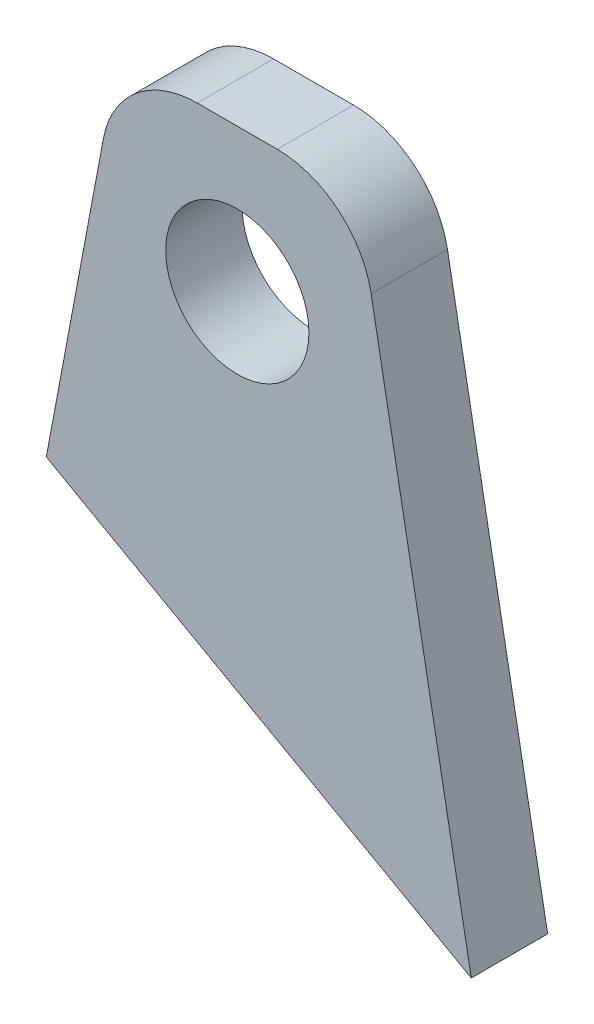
ISO-10303-21;
HEADER;
FILE_DESCRIPTION(('STEP AP214'),'2;1');
FILE_NAME('part.step','',(''),(''),'','','');
FILE_SCHEMA(('AUTOMOTIVE_DESIGN { 1 0 10303 214 1 1 1 1 }'));
ENDSEC;
DATA;
#1=APPLICATION_CONTEXT('core data for automotive mechanical design processes');
#2=APPLICATION_PROTOCOL_DEFINITION('international standard','automotive_design',2000,#1);
#3=PRODUCT_CONTEXT('',#1,'mechanical');
#4=PRODUCT('Part','Part','',(#3));
#5=PRODUCT_RELATED_PRODUCT_CATEGORY('part','',(#4));
#6=PRODUCT_DEFINITION_FORMATION('','',#4);
#7=PRODUCT_DEFINITION_CONTEXT('part definition',#1,'design');
#8=PRODUCT_DEFINITION('design','',#6,#7);
#9=PRODUCT_DEFINITION_SHAPE('','',#8);
#10=(LENGTH_UNIT() NAMED_UNIT(*) SI_UNIT(.MILLI.,.METRE.));
#11=(NAMED_UNIT(*) PLANE_ANGLE_UNIT() SI_UNIT($,.RADIAN.));
#12=(NAMED_UNIT(*) SI_UNIT($,.STERADIAN.) SOLID_ANGLE_UNIT());
#13=UNCERTAINTY_MEASURE_WITH_UNIT(LENGTH_MEASURE(1.E-05),#10,'distance_accuracy_value','');
#14=(GEOMETRIC_REPRESENTATION_CONTEXT(3) GLOBAL_UNCERTAINTY_ASSIGNED_CONTEXT((#13)) GLOBAL_UNIT_ASSIGNED_CONTEXT((#10,
#11,#12)) REPRESENTATION_CONTEXT('',''));
#15=CARTESIAN_POINT('',(0.,0.,0.));
#16=DIRECTION('',(0.,0.,1.));
#17=DIRECTION('',(1.,0.,0.));
#18=AXIS2_PLACEMENT_3D('',#15,#16,#17);
#19=CARTESIAN_POINT('',(-8.40147425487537,9.99999999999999,16.));
#20=DIRECTION('',(0.,0.,1.));
#21=DIRECTION('',(1.,0.,0.));
#22=AXIS2_PLACEMENT_3D('',#19,#20,#21);
#23=PLANE('',#22);
#24=CARTESIAN_POINT('',(-8.40147425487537,9.99999999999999,16.));
#25=DIRECTION('',(0.,0.,1.));
#26=DIRECTION('',(1.,0.,0.));
#27=AXIS2_PLACEMENT_3D('',#24,#25,#26);
#28=CIRCLE('',#27,20.);
#29=CARTESIAN_POINT('',(-8.40147425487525,30.,16.));
#30=VERTEX_POINT('',#29);
#31=CARTESIAN_POINT('',(-28.0589179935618,13.6857707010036,16.));
#32=VERTEX_POINT('',#31);
#33=EDGE_CURVE('E135',#30,#32,#28,.T.);
#34=ORIENTED_EDGE('',*,*,#33,.T.);
#35=DIRECTION('',(-0.184288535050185,-0.982872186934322,0.));
#36=VECTOR('',#35,1.);
#37=CARTESIAN_POINT('',(-28.0589179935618,13.6857707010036,16.));
#38=LINE('',#37,#36);
#39=CARTESIAN_POINT('',(-40.,-50.,16.));
#40=VERTEX_POINT('',#39);
#41=EDGE_CURVE('E93',#32,#40,#38,.T.);
#42=ORIENTED_EDGE('',*,*,#41,.T.);
#43=DIRECTION('',(0.87183702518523,-0.489796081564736,0.));
#44=VECTOR('',#43,1.);
#45=CARTESIAN_POINT('',(49.,-100.,16.));
#46=LINE('',#45,#44);
#47=CARTESIAN_POINT('',(49.,-100.,16.));
#48=VERTEX_POINT('',#47);
#49=EDGE_CURVE('E106',#40,#48,#46,.T.);
#50=ORIENTED_EDGE('',*,*,#49,.T.);
#51=DIRECTION('',(-0.181547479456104,0.983382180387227,0.));
#52=VECTOR('',#51,1.);
#53=CARTESIAN_POINT('',(28.0219785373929,13.6309495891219,16.));
#54=LINE('',#53,#52);
#55=CARTESIAN_POINT('',(28.0219785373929,13.6309495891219,16.));
#56=VERTEX_POINT('',#55);
#57=EDGE_CURVE('E100',#48,#56,#54,.T.);
#58=ORIENTED_EDGE('',*,*,#57,.T.);
#59=CARTESIAN_POINT('',(8.35433492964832,10.,16.));
#60=DIRECTION('',(0.,0.,1.));
#61=DIRECTION('',(1.,0.,0.));
#62=AXIS2_PLACEMENT_3D('',#59,#60,#61);
#63=CIRCLE('',#62,20.);
#64=CARTESIAN_POINT('',(8.35433492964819,30.,16.));
#65=VERTEX_POINT('',#64);
#66=EDGE_CURVE('E104',#56,#65,#63,.T.);
#67=ORIENTED_EDGE('',*,*,#66,.T.);
#68=DIRECTION('',(-1.,0.,0.));
#69=VECTOR('',#68,1.);
#70=CARTESIAN_POINT('',(-8.40147425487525,30.,16.));
#71=LINE('',#70,#69);
#72=EDGE_CURVE('E56',#65,#30,#71,.T.);
#73=ORIENTED_EDGE('',*,*,#72,.T.);
#74=EDGE_LOOP('',(#34,#42,#50,#58,#67,#73));
#75=FACE_BOUND('',#74,.T.);
#76=CARTESIAN_POINT('',(0.,0.,16.));
#77=DIRECTION('',(0.,0.,1.));
#78=DIRECTION('',(1.,0.,0.));
#79=AXIS2_PLACEMENT_3D('',#76,#77,#78);
#80=CIRCLE('',#79,15.);
#81=CARTESIAN_POINT('',(15.,0.,16.));
#82=VERTEX_POINT('',#81);
#83=EDGE_CURVE('E128',#82,#82,#80,.T.);
#84=ORIENTED_EDGE('',*,*,#83,.F.);
#85=EDGE_LOOP('',(#84));
#86=FACE_BOUND('',#85,.T.);
#87=ADVANCED_FACE('F39',(#75,#86),#23,.T.);
#88=CARTESIAN_POINT('',(-8.40147425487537,9.99999999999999,0.));
#89=DIRECTION('',(0.,0.,1.));
#90=DIRECTION('',(1.,0.,0.));
#91=AXIS2_PLACEMENT_3D('',#88,#89,#90);
#92=PLANE('',#91);
#93=CARTESIAN_POINT('',(-8.40147425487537,9.99999999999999,0.));
#94=DIRECTION('',(0.,0.,1.));
#95=DIRECTION('',(1.,0.,0.));
#96=AXIS2_PLACEMENT_3D('',#93,#94,#95);
#97=CIRCLE('',#96,20.);
#98=CARTESIAN_POINT('',(-8.40147425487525,30.,0.));
#99=VERTEX_POINT('',#98);
#100=CARTESIAN_POINT('',(-28.0589179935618,13.6857707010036,0.));
#101=VERTEX_POINT('',#100);
#102=EDGE_CURVE('E124',#99,#101,#97,.T.);
#103=ORIENTED_EDGE('',*,*,#102,.F.);
#104=DIRECTION('',(-1.,0.,0.));
#105=VECTOR('',#104,1.);
#106=CARTESIAN_POINT('',(-8.40147425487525,30.,0.));
#107=LINE('',#106,#105);
#108=CARTESIAN_POINT('',(8.35433492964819,30.,0.));
#109=VERTEX_POINT('',#108);
#110=EDGE_CURVE('E85',#109,#99,#107,.T.);
#111=ORIENTED_EDGE('',*,*,#110,.F.);
#112=CARTESIAN_POINT('',(8.35433492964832,10.,0.));
#113=DIRECTION('',(0.,0.,1.));
#114=DIRECTION('',(1.,0.,0.));
#115=AXIS2_PLACEMENT_3D('',#112,#113,#114);
#116=CIRCLE('',#115,20.);
#117=CARTESIAN_POINT('',(28.0219785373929,13.6309495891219,0.));
#118=VERTEX_POINT('',#117);
#119=EDGE_CURVE('E79',#118,#109,#116,.T.);
#120=ORIENTED_EDGE('',*,*,#119,.F.);
#121=DIRECTION('',(-0.181547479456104,0.983382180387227,0.));
#122=VECTOR('',#121,1.);
#123=CARTESIAN_POINT('',(28.0219785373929,13.6309495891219,0.));
#124=LINE('',#123,#122);
#125=CARTESIAN_POINT('',(49.,-100.,0.));
#126=VERTEX_POINT('',#125);
#127=EDGE_CURVE('E114',#126,#118,#124,.T.);
#128=ORIENTED_EDGE('',*,*,#127,.F.);
#129=DIRECTION('',(0.87183702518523,-0.489796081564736,0.));
#130=VECTOR('',#129,1.);
#131=CARTESIAN_POINT('',(49.,-100.,0.));
#132=LINE('',#131,#130);
#133=CARTESIAN_POINT('',(-40.,-50.,0.));
#134=VERTEX_POINT('',#133);
#135=EDGE_CURVE('E130',#134,#126,#132,.T.);
#136=ORIENTED_EDGE('',*,*,#135,.F.);
#137=DIRECTION('',(-0.184288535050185,-0.982872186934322,0.));
#138=VECTOR('',#137,1.);
#139=CARTESIAN_POINT('',(-28.0589179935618,13.6857707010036,0.));
#140=LINE('',#139,#138);
#141=EDGE_CURVE('E127',#101,#134,#140,.T.);
#142=ORIENTED_EDGE('',*,*,#141,.F.);
#143=EDGE_LOOP('',(#103,#111,#120,#128,#136,#142));
#144=FACE_BOUND('',#143,.T.);
#145=CARTESIAN_POINT('',(0.,0.,0.));
#146=DIRECTION('',(0.,0.,1.));
#147=DIRECTION('',(1.,0.,0.));
#148=AXIS2_PLACEMENT_3D('',#145,#146,#147);
#149=CIRCLE('',#148,15.);
#150=CARTESIAN_POINT('',(15.,0.,0.));
#151=VERTEX_POINT('',#150);
#152=EDGE_CURVE('E210',#151,#151,#149,.T.);
#153=ORIENTED_EDGE('',*,*,#152,.T.);
#154=EDGE_LOOP('',(#153));
#155=FACE_BOUND('',#154,.T.);
#156=ADVANCED_FACE('F144',(#144,#155),#92,.F.);
#157=CARTESIAN_POINT('',(-8.40147425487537,9.99999999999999,16.));
#158=DIRECTION('',(0.,0.,-1.));
#159=DIRECTION('',(-1.,0.,0.));
#160=AXIS2_PLACEMENT_3D('',#157,#158,#159);
#161=CYLINDRICAL_SURFACE('',#160,20.);
#162=ORIENTED_EDGE('',*,*,#102,.T.);
#163=DIRECTION('',(0.,0.,-1.));
#164=VECTOR('',#163,1.);
#165=CARTESIAN_POINT('',(-28.0589179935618,13.6857707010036,16.));
#166=LINE('',#165,#164);
#167=EDGE_CURVE('E11',#32,#101,#166,.T.);
#168=ORIENTED_EDGE('',*,*,#167,.F.);
#169=ORIENTED_EDGE('',*,*,#33,.F.);
#170=DIRECTION('',(0.,0.,-1.));
#171=VECTOR('',#170,1.);
#172=CARTESIAN_POINT('',(-8.40147425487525,30.,16.));
#173=LINE('',#172,#171);
#174=EDGE_CURVE('E120',#30,#99,#173,.T.);
#175=ORIENTED_EDGE('',*,*,#174,.T.);
#176=EDGE_LOOP('',(#162,#168,#169,#175));
#177=FACE_BOUND('',#176,.T.);
#178=ADVANCED_FACE('F41',(#177),#161,.T.);
#179=CARTESIAN_POINT('',(-28.0589179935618,13.6857707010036,16.));
#180=DIRECTION('',(0.982872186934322,-0.184288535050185,0.));
#181=DIRECTION('',(0.184288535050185,0.982872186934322,0.));
#182=AXIS2_PLACEMENT_3D('',#179,#180,#181);
#183=PLANE('',#182);
#184=ORIENTED_EDGE('',*,*,#141,.T.);
#185=DIRECTION('',(0.,0.,-1.));
#186=VECTOR('',#185,1.);
#187=CARTESIAN_POINT('',(-40.,-50.,16.));
#188=LINE('',#187,#186);
#189=EDGE_CURVE('E48',#40,#134,#188,.T.);
#190=ORIENTED_EDGE('',*,*,#189,.F.);
#191=ORIENTED_EDGE('',*,*,#41,.F.);
#192=ORIENTED_EDGE('',*,*,#167,.T.);
#193=EDGE_LOOP('',(#184,#190,#191,#192));
#194=FACE_BOUND('',#193,.T.);
#195=ADVANCED_FACE('F169',(#194),#183,.F.);
#196=CARTESIAN_POINT('',(49.,-100.,16.));
#197=DIRECTION('',(0.489796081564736,0.87183702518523,0.));
#198=DIRECTION('',(-0.87183702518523,0.489796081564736,0.));
#199=AXIS2_PLACEMENT_3D('',#196,#197,#198);
#200=PLANE('',#199);
#201=ORIENTED_EDGE('',*,*,#135,.T.);
#202=DIRECTION('',(0.,0.,-1.));
#203=VECTOR('',#202,1.);
#204=CARTESIAN_POINT('',(49.,-100.,16.));
#205=LINE('',#204,#203);
#206=EDGE_CURVE('E115',#48,#126,#205,.T.);
#207=ORIENTED_EDGE('',*,*,#206,.F.);
#208=ORIENTED_EDGE('',*,*,#49,.F.);
#209=ORIENTED_EDGE('',*,*,#189,.T.);
#210=EDGE_LOOP('',(#201,#207,#208,#209));
#211=FACE_BOUND('',#210,.T.);
#212=ADVANCED_FACE('F141',(#211),#200,.F.);
#213=CARTESIAN_POINT('',(28.0219785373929,13.6309495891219,16.));
#214=DIRECTION('',(-0.983382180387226,-0.181547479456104,0.));
#215=DIRECTION('',(0.181547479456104,-0.983382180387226,0.));
#216=AXIS2_PLACEMENT_3D('',#213,#214,#215);
#217=PLANE('',#216);
#218=ORIENTED_EDGE('',*,*,#127,.T.);
#219=DIRECTION('',(0.,0.,-1.));
#220=VECTOR('',#219,1.);
#221=CARTESIAN_POINT('',(28.0219785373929,13.6309495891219,16.));
#222=LINE('',#221,#220);
#223=EDGE_CURVE('E111',#56,#118,#222,.T.);
#224=ORIENTED_EDGE('',*,*,#223,.F.);
#225=ORIENTED_EDGE('',*,*,#57,.F.);
#226=ORIENTED_EDGE('',*,*,#206,.T.);
#227=EDGE_LOOP('',(#218,#224,#225,#226));
#228=FACE_BOUND('',#227,.T.);
#229=ADVANCED_FACE('F112',(#228),#217,.F.);
#230=CARTESIAN_POINT('',(8.35433492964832,10.,16.));
#231=DIRECTION('',(0.,0.,-1.));
#232=DIRECTION('',(-1.,0.,0.));
#233=AXIS2_PLACEMENT_3D('',#230,#231,#232);
#234=CYLINDRICAL_SURFACE('',#233,20.);
#235=ORIENTED_EDGE('',*,*,#119,.T.);
#236=DIRECTION('',(0.,0.,-1.));
#237=VECTOR('',#236,1.);
#238=CARTESIAN_POINT('',(8.35433492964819,30.,16.));
#239=LINE('',#238,#237);
#240=EDGE_CURVE('E116',#65,#109,#239,.T.);
#241=ORIENTED_EDGE('',*,*,#240,.F.);
#242=ORIENTED_EDGE('',*,*,#66,.F.);
#243=ORIENTED_EDGE('',*,*,#223,.T.);
#244=EDGE_LOOP('',(#235,#241,#242,#243));
#245=FACE_BOUND('',#244,.T.);
#246=ADVANCED_FACE('F118',(#245),#234,.T.);
#247=CARTESIAN_POINT('',(-8.40147425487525,30.,16.));
#248=DIRECTION('',(0.,-1.,0.));
#249=DIRECTION('',(0.,0.,-1.));
#250=AXIS2_PLACEMENT_3D('',#247,#248,#249);
#251=PLANE('',#250);
#252=ORIENTED_EDGE('',*,*,#110,.T.);
#253=ORIENTED_EDGE('',*,*,#174,.F.);
#254=ORIENTED_EDGE('',*,*,#72,.F.);
#255=ORIENTED_EDGE('',*,*,#240,.T.);
#256=EDGE_LOOP('',(#252,#253,#254,#255));
#257=FACE_BOUND('',#256,.T.);
#258=ADVANCED_FACE('F149',(#257),#251,.F.);
#259=CARTESIAN_POINT('',(0.,0.,16.));
#260=DIRECTION('',(0.,0.,-1.));
#261=DIRECTION('',(-1.,0.,0.));
#262=AXIS2_PLACEMENT_3D('',#259,#260,#261);
#263=CYLINDRICAL_SURFACE('',#262,15.);
#264=ORIENTED_EDGE('',*,*,#83,.T.);
#265=EDGE_LOOP('',(#264));
#266=FACE_BOUND('',#265,.T.);
#267=ORIENTED_EDGE('',*,*,#152,.F.);
#268=EDGE_LOOP('',(#267));
#269=FACE_BOUND('',#268,.T.);
#270=ADVANCED_FACE('F151',(#266,#269),#263,.F.);
#271=CLOSED_SHELL('',(#87,#156,#178,#195,#212,#229,#246,#258,#270));
#272=MANIFOLD_SOLID_BREP('B2',#271);
#273=ADVANCED_BREP_SHAPE_REPRESENTATION('',(#18,#272),#14);
#274=SHAPE_DEFINITION_REPRESENTATION(#9,#273);
ENDSEC;
END-ISO-10303-21;
